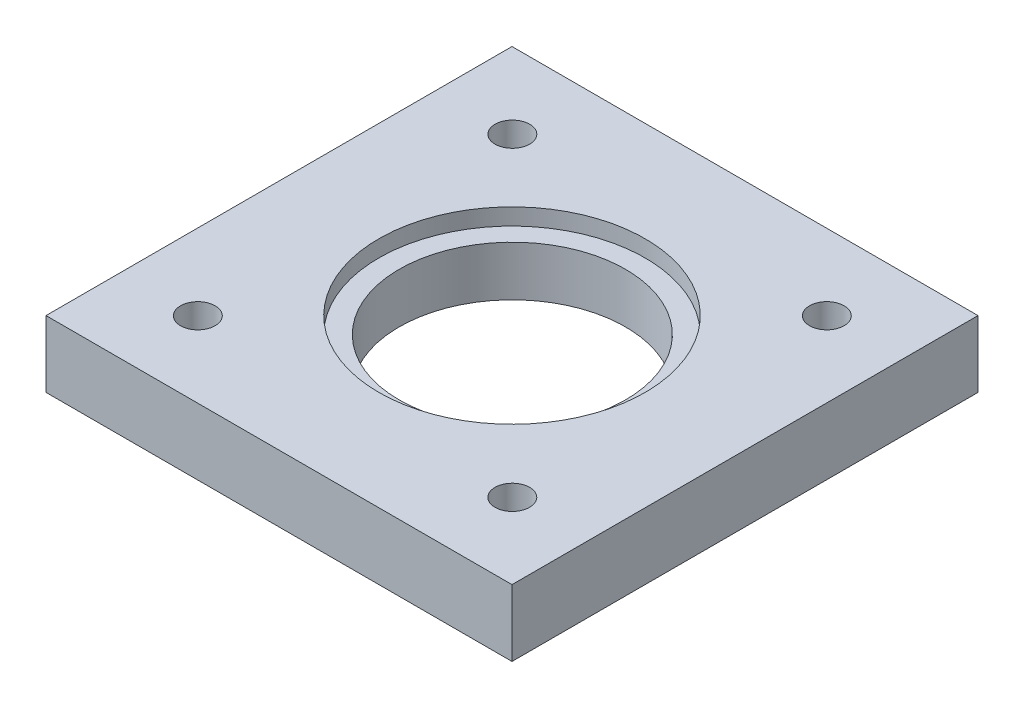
from build123d import *

# Parameters (mm, degrees)
SKETCH1_W           = 70
SKETCH1_H           = 70
BOSS_EXTRUDE1_DEPTH = 10
SKETCH2_R           = 2.6
CUT_EXTRUDE1_DEPTH  = 55.423309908
SKETCH3_R           = 20
CUT_EXTRUDE2_DEPTH  = 2.5
SKETCH4_R           = 17
CUT_EXTRUDE3_DEPTH  = 55.019872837


with BuildPart() as part:
    # Sketch1 → Boss-Extrude1 (new body)
    with BuildSketch(Plane(origin=(0, 0, 0), x_dir=(1, 0, 0), z_dir=(0, 1, 0))):
        with Locations((-3.307086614, -2.342519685)):
            Rectangle(SKETCH1_W, SKETCH1_H)
    extrude(amount=BOSS_EXTRUDE1_DEPTH)

    # Sketch2 → Cut-Extrude1 (cut, through all)
    with BuildSketch(Plane(origin=(0, 10, 0), x_dir=(1, 0, 0), z_dir=(0, 1, 0))):
        with Locations(Location((-26.877086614, 21.279480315, 0), (0, 0, 270))):
            Circle(SKETCH2_R)
        with Locations(Location((20.362913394, 21.279480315, 0), (0, 0, 270))):
            Circle(SKETCH2_R)
        with Locations(Location((20.362913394, -25.964519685, 0), (0, 0, 270))):
            Circle(SKETCH2_R)
        with Locations(Location((-26.877086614, -25.964519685, 0), (0, 0, 270))):
            Circle(SKETCH2_R)
    extrude(amount=-CUT_EXTRUDE1_DEPTH, mode=Mode.SUBTRACT)

    # Sketch3 → Cut-Extrude2 (cut)
    with BuildSketch(Plane(origin=(0, 10, 0), x_dir=(1, 0, 0), z_dir=(0, 1, 0))):
        with Locations(Location((-3.30708651, -2.342519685, 0), (0, 0, 270))):
            Circle(SKETCH3_R)
    extrude(amount=-CUT_EXTRUDE2_DEPTH, mode=Mode.SUBTRACT)

    # Sketch4 → Cut-Extrude3 (cut, through all)
    with BuildSketch(Plane(origin=(0, 7.5, 0), x_dir=(1, 0, 0), z_dir=(0, 1, 0))):
        with Locations(Location((-3.307086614, -2.290519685, 0), (0, 0, 270))):
            Circle(SKETCH4_R)
    extrude(amount=-CUT_EXTRUDE3_DEPTH, mode=Mode.SUBTRACT)


solid = part.part
